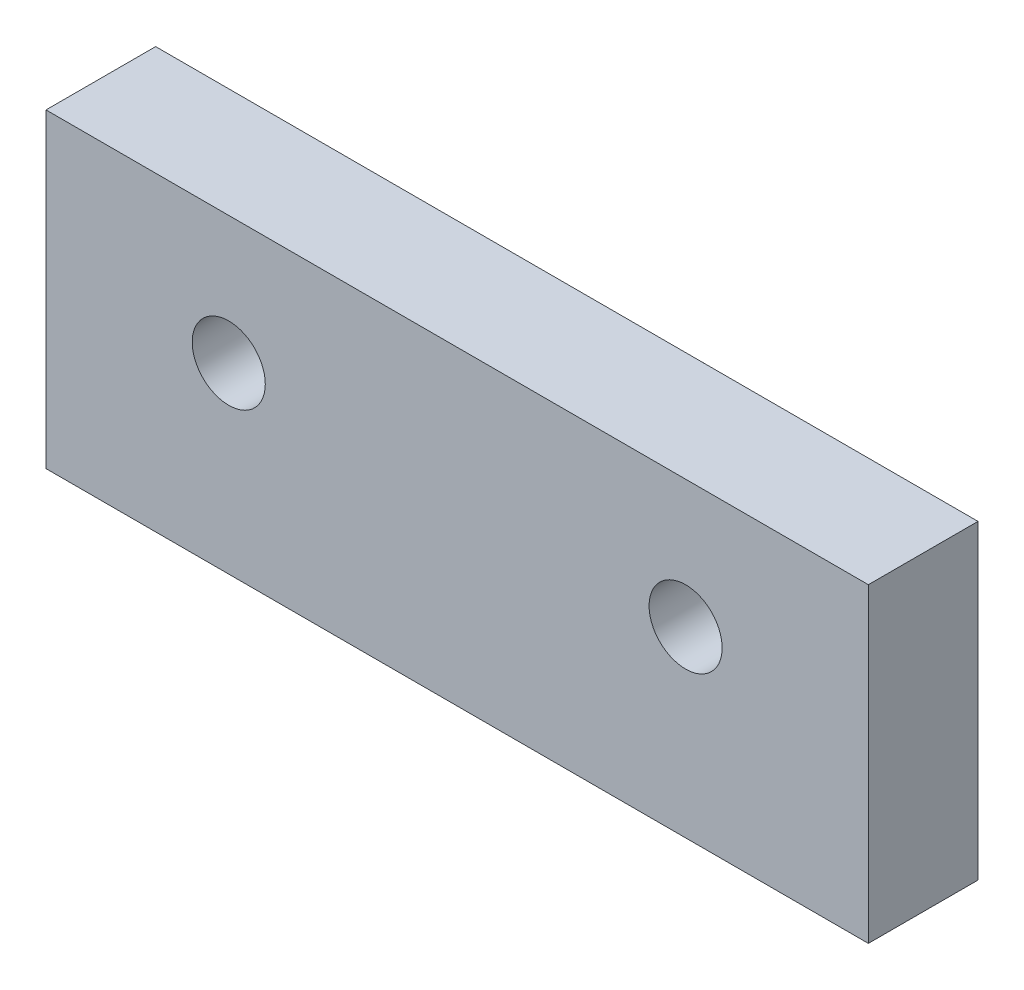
from build123d import *

# Parameters (mm, degrees)
ESQUISSE1_W             = 45
ESQUISSE1_H             = 17
BOSS_EXTRU_1_DEPTH      = 6
ESQUISSE2_R             = 2
ENL_V_MAT_EXTRU_1_DEPTH = 6


with BuildPart() as part:
    # Esquisse1 → Boss.-Extru.1 (new body)
    with BuildSketch(Plane.XY):
        Rectangle(ESQUISSE1_W, ESQUISSE1_H)
    extrude(amount=BOSS_EXTRU_1_DEPTH)

    # Esquisse2 → Enl_v. mat.-Extru.1 (cut)
    with BuildSketch(Plane.XY.offset(6)):
        with Locations((-12.5, 1.5)):
            Circle(ESQUISSE2_R)
    enl_v_mat_extru_1 = extrude(amount=-ENL_V_MAT_EXTRU_1_DEPTH, mode=Mode.SUBTRACT)

    # Sym_trie1: Enl_v. mat.-Extru.1 across plane
    add(enl_v_mat_extru_1.mirror(Plane(origin=(0, 0, 0), x_dir=(0, 0, 1), z_dir=(1, 0, 0))), mode=Mode.SUBTRACT)


solid = part.part
